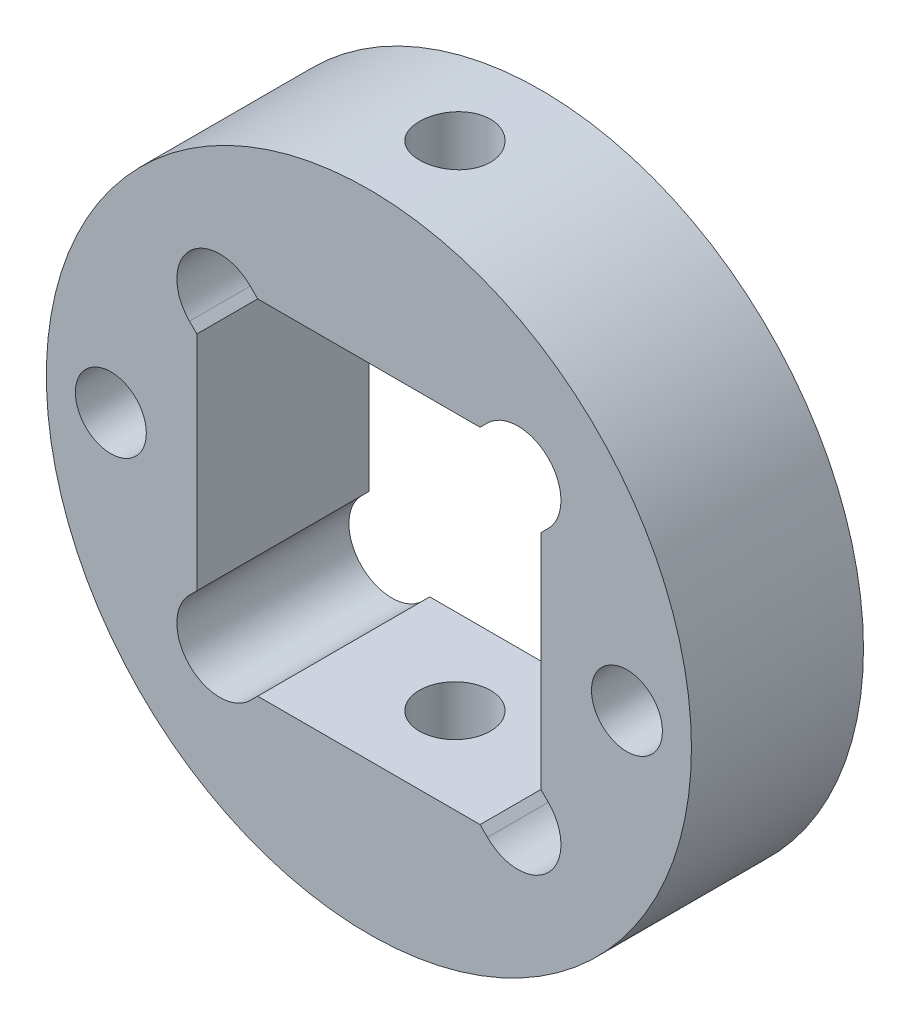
from build123d import *

# Parameters (mm, degrees)
ESQUISSE1_R           = 15
BOSS_EXTRU_1_DEPTH    = 4
TROU_TARAUD_M41_D     = 3.3
TROU_TARAUD_M42_D     = 3.3
TROU_TARAUD_M42_DEPTH = 7


with BuildPart() as part:
    # Esquisse1 → Boss.-Extru.1 (new, symmetric)
    with BuildSketch(Plane.XY):
        Circle(ESQUISSE1_R)
        with BuildLine():
            Line((-5.171572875, 8), (5.171572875, 8))
            Line((5.171572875, 8), (5.515432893, 8.343860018))
            ThreePointArc((5.515432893, 8.343860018), (8.343860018, 8.343860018), (8.343860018, 5.515432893))
            Line((8.343860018, 5.515432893), (8, 5.171572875))
            Line((8, 5.171572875), (8, -5.171572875))
            Line((8, -5.171572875), (8.343860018, -5.515432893))
            ThreePointArc((8.343860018, -5.515432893), (8.343860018, -8.343860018), (5.515432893, -8.343860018))
            Line((5.515432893, -8.343860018), (5.171572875, -8))
            Line((5.171572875, -8), (-5.171572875, -8))
            Line((-5.171572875, -8), (-5.515432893, -8.343860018))
            ThreePointArc((-5.515432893, -8.343860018), (-8.343860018, -8.343860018), (-8.343860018, -5.515432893))
            Line((-8.343860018, -5.515432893), (-8, -5.171572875))
            Line((-8, -5.171572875), (-8, 5.171572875))
            Line((-8, 5.171572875), (-8.343860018, 5.515432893))
            ThreePointArc((-8.343860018, 5.515432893), (-8.343860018, 8.343860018), (-5.515432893, 8.343860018))
            Line((-5.515432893, 8.343860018), (-5.171572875, 8))
        make_face(mode=Mode.SUBTRACT)
    extrude(amount=BOSS_EXTRU_1_DEPTH, both=True)

    # Trou taraud_ M41 (through all)
    with Locations(Plane.XY.offset(4)):
        with Locations((12, 0)):
            trou_taraud_m41 = Hole(TROU_TARAUD_M41_D / 2)

    # Sym_trie1: Trou taraud_ M41 across plane
    add(trou_taraud_m41.mirror(Plane(origin=(0, 0, 0), x_dir=(0, 0, 1), z_dir=(1, 0, 0))), mode=Mode.SUBTRACT)

    # Trou taraud_ M42
    with Locations(Plane(origin=(0, -8, 0), x_dir=(-1, 0, 0), z_dir=(0, 1, 0))):
        with Locations((0, 0)):
            trou_taraud_m42 = Hole(TROU_TARAUD_M42_D / 2, depth=TROU_TARAUD_M42_DEPTH)

    # Sym_trie2: Trou taraud_ M42 across plane
    add(trou_taraud_m42.mirror(Plane.ZX), mode=Mode.SUBTRACT)


solid = part.part
